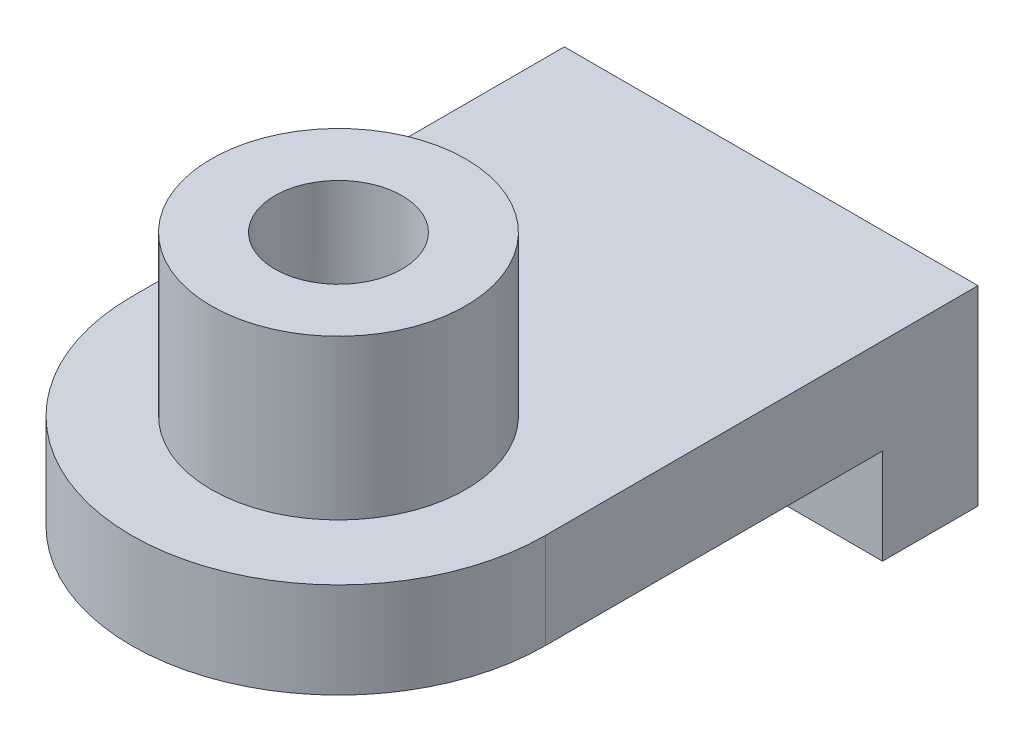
ISO-10303-21;
HEADER;
FILE_DESCRIPTION(('STEP AP214'),'2;1');
FILE_NAME('part.step','',(''),(''),'','','');
FILE_SCHEMA(('AUTOMOTIVE_DESIGN { 1 0 10303 214 1 1 1 1 }'));
ENDSEC;
DATA;
#1=APPLICATION_CONTEXT('core data for automotive mechanical design processes');
#2=APPLICATION_PROTOCOL_DEFINITION('international standard','automotive_design',2000,#1);
#3=PRODUCT_CONTEXT('',#1,'mechanical');
#4=PRODUCT('Part','Part','',(#3));
#5=PRODUCT_RELATED_PRODUCT_CATEGORY('part','',(#4));
#6=PRODUCT_DEFINITION_FORMATION('','',#4);
#7=PRODUCT_DEFINITION_CONTEXT('part definition',#1,'design');
#8=PRODUCT_DEFINITION('design','',#6,#7);
#9=PRODUCT_DEFINITION_SHAPE('','',#8);
#10=(LENGTH_UNIT() NAMED_UNIT(*) SI_UNIT(.MILLI.,.METRE.));
#11=(NAMED_UNIT(*) PLANE_ANGLE_UNIT() SI_UNIT($,.RADIAN.));
#12=(NAMED_UNIT(*) SI_UNIT($,.STERADIAN.) SOLID_ANGLE_UNIT());
#13=UNCERTAINTY_MEASURE_WITH_UNIT(LENGTH_MEASURE(1.E-05),#10,'distance_accuracy_value','');
#14=(GEOMETRIC_REPRESENTATION_CONTEXT(3) GLOBAL_UNCERTAINTY_ASSIGNED_CONTEXT((#13)) GLOBAL_UNIT_ASSIGNED_CONTEXT((#10,
#11,#12)) REPRESENTATION_CONTEXT('',''));
#15=CARTESIAN_POINT('',(0.,0.,0.));
#16=DIRECTION('',(0.,0.,1.));
#17=DIRECTION('',(1.,0.,0.));
#18=AXIS2_PLACEMENT_3D('',#15,#16,#17);
#19=CARTESIAN_POINT('',(0.,15.,0.));
#20=DIRECTION('',(0.,-1.,0.));
#21=DIRECTION('',(0.,0.,-1.));
#22=AXIS2_PLACEMENT_3D('',#19,#20,#21);
#23=PLANE('',#22);
#24=CARTESIAN_POINT('',(0.,15.,0.));
#25=DIRECTION('',(0.,-1.,0.));
#26=DIRECTION('',(0.,0.,-1.));
#27=AXIS2_PLACEMENT_3D('',#24,#25,#26);
#28=CIRCLE('',#27,32.5);
#29=CARTESIAN_POINT('',(32.5,15.,0.));
#30=VERTEX_POINT('',#29);
#31=CARTESIAN_POINT('',(-32.5,15.,0.));
#32=VERTEX_POINT('',#31);
#33=EDGE_CURVE('E137',#30,#32,#28,.T.);
#34=ORIENTED_EDGE('',*,*,#33,.F.);
#35=DIRECTION('',(0.,0.,-1.));
#36=VECTOR('',#35,1.);
#37=CARTESIAN_POINT('',(32.5,15.,0.));
#38=LINE('',#37,#36);
#39=CARTESIAN_POINT('',(32.5,15.,-68.));
#40=VERTEX_POINT('',#39);
#41=EDGE_CURVE('E152',#30,#40,#38,.T.);
#42=ORIENTED_EDGE('',*,*,#41,.T.);
#43=DIRECTION('',(1.,0.,0.));
#44=VECTOR('',#43,1.);
#45=CARTESIAN_POINT('',(-32.5,15.,-68.));
#46=LINE('',#45,#44);
#47=CARTESIAN_POINT('',(-32.5,15.,-68.));
#48=VERTEX_POINT('',#47);
#49=EDGE_CURVE('E89',#48,#40,#46,.T.);
#50=ORIENTED_EDGE('',*,*,#49,.F.);
#51=DIRECTION('',(0.,0.,1.));
#52=VECTOR('',#51,1.);
#53=CARTESIAN_POINT('',(-32.5,15.,-68.));
#54=LINE('',#53,#52);
#55=EDGE_CURVE('E149',#48,#32,#54,.T.);
#56=ORIENTED_EDGE('',*,*,#55,.T.);
#57=EDGE_LOOP('',(#34,#42,#50,#56));
#58=FACE_BOUND('',#57,.T.);
#59=CARTESIAN_POINT('',(0.,15.,0.));
#60=DIRECTION('',(0.,-1.,0.));
#61=DIRECTION('',(0.,0.,-1.));
#62=AXIS2_PLACEMENT_3D('',#59,#60,#61);
#63=CIRCLE('',#62,20.);
#64=CARTESIAN_POINT('',(0.,15.,-20.));
#65=VERTEX_POINT('',#64);
#66=EDGE_CURVE('E11',#65,#65,#63,.F.);
#67=ORIENTED_EDGE('',*,*,#66,.F.);
#68=EDGE_LOOP('',(#67));
#69=FACE_BOUND('',#68,.T.);
#70=ADVANCED_FACE('F28',(#58,#69),#23,.F.);
#71=CARTESIAN_POINT('',(0.,0.,0.));
#72=DIRECTION('',(0.,-1.,0.));
#73=DIRECTION('',(0.,0.,-1.));
#74=AXIS2_PLACEMENT_3D('',#71,#72,#73);
#75=PLANE('',#74);
#76=DIRECTION('',(0.,0.,1.));
#77=VECTOR('',#76,1.);
#78=CARTESIAN_POINT('',(-32.5,0.,-68.));
#79=LINE('',#78,#77);
#80=CARTESIAN_POINT('',(-32.5,0.,-53.));
#81=VERTEX_POINT('',#80);
#82=CARTESIAN_POINT('',(-32.5,0.,0.));
#83=VERTEX_POINT('',#82);
#84=EDGE_CURVE('E128',#81,#83,#79,.T.);
#85=ORIENTED_EDGE('',*,*,#84,.F.);
#86=DIRECTION('',(1.,0.,0.));
#87=VECTOR('',#86,1.);
#88=CARTESIAN_POINT('',(-32.5,0.,-53.));
#89=LINE('',#88,#87);
#90=CARTESIAN_POINT('',(32.5,0.,-53.));
#91=VERTEX_POINT('',#90);
#92=EDGE_CURVE('E118',#81,#91,#89,.T.);
#93=ORIENTED_EDGE('',*,*,#92,.T.);
#94=DIRECTION('',(0.,0.,-1.));
#95=VECTOR('',#94,1.);
#96=CARTESIAN_POINT('',(32.5,0.,0.));
#97=LINE('',#96,#95);
#98=CARTESIAN_POINT('',(32.5,0.,0.));
#99=VERTEX_POINT('',#98);
#100=EDGE_CURVE('E135',#99,#91,#97,.T.);
#101=ORIENTED_EDGE('',*,*,#100,.F.);
#102=CARTESIAN_POINT('',(0.,0.,0.));
#103=DIRECTION('',(0.,-1.,0.));
#104=DIRECTION('',(0.,0.,-1.));
#105=AXIS2_PLACEMENT_3D('',#102,#103,#104);
#106=CIRCLE('',#105,32.5);
#107=EDGE_CURVE('E100',#99,#83,#106,.T.);
#108=ORIENTED_EDGE('',*,*,#107,.T.);
#109=EDGE_LOOP('',(#85,#93,#101,#108));
#110=FACE_BOUND('',#109,.T.);
#111=ADVANCED_FACE('F134',(#110),#75,.T.);
#112=CARTESIAN_POINT('',(0.,15.,0.));
#113=DIRECTION('',(0.,-1.,0.));
#114=DIRECTION('',(0.,0.,-1.));
#115=AXIS2_PLACEMENT_3D('',#112,#113,#114);
#116=CYLINDRICAL_SURFACE('',#115,32.5);
#117=ORIENTED_EDGE('',*,*,#107,.F.);
#118=DIRECTION('',(0.,-1.,0.));
#119=VECTOR('',#118,1.);
#120=CARTESIAN_POINT('',(32.5,15.,0.));
#121=LINE('',#120,#119);
#122=EDGE_CURVE('E36',#30,#99,#121,.T.);
#123=ORIENTED_EDGE('',*,*,#122,.F.);
#124=ORIENTED_EDGE('',*,*,#33,.T.);
#125=DIRECTION('',(0.,-1.,0.));
#126=VECTOR('',#125,1.);
#127=CARTESIAN_POINT('',(-32.5,15.,0.));
#128=LINE('',#127,#126);
#129=EDGE_CURVE('E142',#32,#83,#128,.T.);
#130=ORIENTED_EDGE('',*,*,#129,.T.);
#131=EDGE_LOOP('',(#117,#123,#124,#130));
#132=FACE_BOUND('',#131,.T.);
#133=ADVANCED_FACE('F30',(#132),#116,.T.);
#134=CARTESIAN_POINT('',(32.5,15.,0.));
#135=DIRECTION('',(-1.,0.,0.));
#136=DIRECTION('',(0.,0.,1.));
#137=AXIS2_PLACEMENT_3D('',#134,#135,#136);
#138=PLANE('',#137);
#139=ORIENTED_EDGE('',*,*,#100,.T.);
#140=DIRECTION('',(0.,1.,0.));
#141=VECTOR('',#140,1.);
#142=CARTESIAN_POINT('',(32.5,-15.,-53.));
#143=LINE('',#142,#141);
#144=CARTESIAN_POINT('',(32.5,-15.,-53.));
#145=VERTEX_POINT('',#144);
#146=EDGE_CURVE('E43',#145,#91,#143,.T.);
#147=ORIENTED_EDGE('',*,*,#146,.F.);
#148=DIRECTION('',(0.,0.,-1.));
#149=VECTOR('',#148,1.);
#150=CARTESIAN_POINT('',(32.5,-15.,-53.));
#151=LINE('',#150,#149);
#152=CARTESIAN_POINT('',(32.5,-15.,-68.));
#153=VERTEX_POINT('',#152);
#154=EDGE_CURVE('E97',#145,#153,#151,.T.);
#155=ORIENTED_EDGE('',*,*,#154,.T.);
#156=DIRECTION('',(0.,-1.,0.));
#157=VECTOR('',#156,1.);
#158=CARTESIAN_POINT('',(32.5,15.,-68.));
#159=LINE('',#158,#157);
#160=EDGE_CURVE('E83',#40,#153,#159,.T.);
#161=ORIENTED_EDGE('',*,*,#160,.F.);
#162=ORIENTED_EDGE('',*,*,#41,.F.);
#163=ORIENTED_EDGE('',*,*,#122,.T.);
#164=EDGE_LOOP('',(#139,#147,#155,#161,#162,#163));
#165=FACE_BOUND('',#164,.T.);
#166=ADVANCED_FACE('F104',(#165),#138,.F.);
#167=CARTESIAN_POINT('',(-32.5,15.,-68.));
#168=DIRECTION('',(0.,0.,-1.));
#169=DIRECTION('',(-1.,0.,0.));
#170=AXIS2_PLACEMENT_3D('',#167,#168,#169);
#171=PLANE('',#170);
#172=ORIENTED_EDGE('',*,*,#160,.T.);
#173=DIRECTION('',(1.,0.,0.));
#174=VECTOR('',#173,1.);
#175=CARTESIAN_POINT('',(-32.5,-15.,-68.));
#176=LINE('',#175,#174);
#177=CARTESIAN_POINT('',(-32.5,-15.,-68.));
#178=VERTEX_POINT('',#177);
#179=EDGE_CURVE('E86',#178,#153,#176,.T.);
#180=ORIENTED_EDGE('',*,*,#179,.F.);
#181=DIRECTION('',(0.,-1.,0.));
#182=VECTOR('',#181,1.);
#183=CARTESIAN_POINT('',(-32.5,15.,-68.));
#184=LINE('',#183,#182);
#185=EDGE_CURVE('E92',#48,#178,#184,.T.);
#186=ORIENTED_EDGE('',*,*,#185,.F.);
#187=ORIENTED_EDGE('',*,*,#49,.T.);
#188=EDGE_LOOP('',(#172,#180,#186,#187));
#189=FACE_BOUND('',#188,.T.);
#190=ADVANCED_FACE('F85',(#189),#171,.T.);
#191=CARTESIAN_POINT('',(-32.5,15.,-68.));
#192=DIRECTION('',(1.,0.,0.));
#193=DIRECTION('',(0.,0.,-1.));
#194=AXIS2_PLACEMENT_3D('',#191,#192,#193);
#195=PLANE('',#194);
#196=ORIENTED_EDGE('',*,*,#185,.T.);
#197=DIRECTION('',(0.,0.,-1.));
#198=VECTOR('',#197,1.);
#199=CARTESIAN_POINT('',(-32.5,-15.,-53.));
#200=LINE('',#199,#198);
#201=CARTESIAN_POINT('',(-32.5,-15.,-53.));
#202=VERTEX_POINT('',#201);
#203=EDGE_CURVE('E99',#202,#178,#200,.T.);
#204=ORIENTED_EDGE('',*,*,#203,.F.);
#205=DIRECTION('',(0.,1.,0.));
#206=VECTOR('',#205,1.);
#207=CARTESIAN_POINT('',(-32.5,-15.,-53.));
#208=LINE('',#207,#206);
#209=EDGE_CURVE('E114',#202,#81,#208,.T.);
#210=ORIENTED_EDGE('',*,*,#209,.T.);
#211=ORIENTED_EDGE('',*,*,#84,.T.);
#212=ORIENTED_EDGE('',*,*,#129,.F.);
#213=ORIENTED_EDGE('',*,*,#55,.F.);
#214=EDGE_LOOP('',(#196,#204,#210,#211,#212,#213));
#215=FACE_BOUND('',#214,.T.);
#216=ADVANCED_FACE('F125',(#215),#195,.F.);
#217=CARTESIAN_POINT('',(-32.5,-15.,-53.));
#218=DIRECTION('',(0.,-1.,0.));
#219=DIRECTION('',(0.,0.,-1.));
#220=AXIS2_PLACEMENT_3D('',#217,#218,#219);
#221=PLANE('',#220);
#222=ORIENTED_EDGE('',*,*,#154,.F.);
#223=DIRECTION('',(1.,0.,0.));
#224=VECTOR('',#223,1.);
#225=CARTESIAN_POINT('',(-32.5,-15.,-53.));
#226=LINE('',#225,#224);
#227=EDGE_CURVE('E101',#202,#145,#226,.T.);
#228=ORIENTED_EDGE('',*,*,#227,.F.);
#229=ORIENTED_EDGE('',*,*,#203,.T.);
#230=ORIENTED_EDGE('',*,*,#179,.T.);
#231=EDGE_LOOP('',(#222,#228,#229,#230));
#232=FACE_BOUND('',#231,.T.);
#233=ADVANCED_FACE('F96',(#232),#221,.T.);
#234=CARTESIAN_POINT('',(-32.5,-15.,-53.));
#235=DIRECTION('',(0.,0.,-1.));
#236=DIRECTION('',(-1.,0.,0.));
#237=AXIS2_PLACEMENT_3D('',#234,#235,#236);
#238=PLANE('',#237);
#239=ORIENTED_EDGE('',*,*,#146,.T.);
#240=ORIENTED_EDGE('',*,*,#92,.F.);
#241=ORIENTED_EDGE('',*,*,#209,.F.);
#242=ORIENTED_EDGE('',*,*,#227,.T.);
#243=EDGE_LOOP('',(#239,#240,#241,#242));
#244=FACE_BOUND('',#243,.T.);
#245=ADVANCED_FACE('F130',(#244),#238,.F.);
#246=CARTESIAN_POINT('',(0.,40.,0.));
#247=DIRECTION('',(0.,-1.,0.));
#248=DIRECTION('',(0.,0.,-1.));
#249=AXIS2_PLACEMENT_3D('',#246,#247,#248);
#250=CYLINDRICAL_SURFACE('',#249,20.);
#251=CARTESIAN_POINT('',(0.,40.,0.));
#252=DIRECTION('',(0.,1.,0.));
#253=DIRECTION('',(0.,0.,1.));
#254=AXIS2_PLACEMENT_3D('',#251,#252,#253);
#255=CIRCLE('',#254,20.);
#256=CARTESIAN_POINT('',(0.,40.,20.));
#257=VERTEX_POINT('',#256);
#258=EDGE_CURVE('E105',#257,#257,#255,.T.);
#259=ORIENTED_EDGE('',*,*,#258,.F.);
#260=EDGE_LOOP('',(#259));
#261=FACE_BOUND('',#260,.T.);
#262=ORIENTED_EDGE('',*,*,#66,.T.);
#263=EDGE_LOOP('',(#262));
#264=FACE_BOUND('',#263,.T.);
#265=ADVANCED_FACE('F162',(#261,#264),#250,.T.);
#266=CARTESIAN_POINT('',(0.,40.,0.));
#267=DIRECTION('',(0.,1.,0.));
#268=DIRECTION('',(0.,0.,1.));
#269=AXIS2_PLACEMENT_3D('',#266,#267,#268);
#270=PLANE('',#269);
#271=CARTESIAN_POINT('',(0.,40.,0.));
#272=DIRECTION('',(0.,1.,0.));
#273=DIRECTION('',(0.,0.,1.));
#274=AXIS2_PLACEMENT_3D('',#271,#272,#273);
#275=CIRCLE('',#274,10.);
#276=CARTESIAN_POINT('',(0.,40.,10.));
#277=VERTEX_POINT('',#276);
#278=EDGE_CURVE('E228',#277,#277,#275,.T.);
#279=ORIENTED_EDGE('',*,*,#278,.F.);
#280=EDGE_LOOP('',(#279));
#281=FACE_BOUND('',#280,.T.);
#282=ORIENTED_EDGE('',*,*,#258,.T.);
#283=EDGE_LOOP('',(#282));
#284=FACE_BOUND('',#283,.T.);
#285=ADVANCED_FACE('F164',(#281,#284),#270,.T.);
#286=CARTESIAN_POINT('',(0.,40.,0.));
#287=DIRECTION('',(0.,1.,0.));
#288=DIRECTION('',(0.,0.,1.));
#289=AXIS2_PLACEMENT_3D('',#286,#287,#288);
#290=CYLINDRICAL_SURFACE('',#289,10.);
#291=ORIENTED_EDGE('',*,*,#278,.T.);
#292=EDGE_LOOP('',(#291));
#293=FACE_BOUND('',#292,.T.);
#294=CARTESIAN_POINT('',(0.,15.,0.));
#295=DIRECTION('',(0.,-1.,0.));
#296=DIRECTION('',(0.,0.,-1.));
#297=AXIS2_PLACEMENT_3D('',#294,#295,#296);
#298=CIRCLE('',#297,10.);
#299=CARTESIAN_POINT('',(0.,15.,-10.));
#300=VERTEX_POINT('',#299);
#301=EDGE_CURVE('E109',#300,#300,#298,.T.);
#302=ORIENTED_EDGE('',*,*,#301,.T.);
#303=EDGE_LOOP('',(#302));
#304=FACE_BOUND('',#303,.T.);
#305=ADVANCED_FACE('F170',(#293,#304),#290,.F.);
#306=CARTESIAN_POINT('',(0.,15.,0.));
#307=DIRECTION('',(0.,-1.,0.));
#308=DIRECTION('',(0.,0.,-1.));
#309=AXIS2_PLACEMENT_3D('',#306,#307,#308);
#310=PLANE('',#309);
#311=ORIENTED_EDGE('',*,*,#301,.F.);
#312=EDGE_LOOP('',(#311));
#313=FACE_BOUND('',#312,.T.);
#314=ADVANCED_FACE('F216',(#313),#310,.F.);
#315=CLOSED_SHELL('',(#70,#111,#133,#166,#190,#216,#233,#245,#265,#285,#305,#314));
#316=MANIFOLD_SOLID_BREP('B2',#315);
#317=ADVANCED_BREP_SHAPE_REPRESENTATION('',(#18,#316),#14);
#318=SHAPE_DEFINITION_REPRESENTATION(#9,#317);
ENDSEC;
END-ISO-10303-21;
